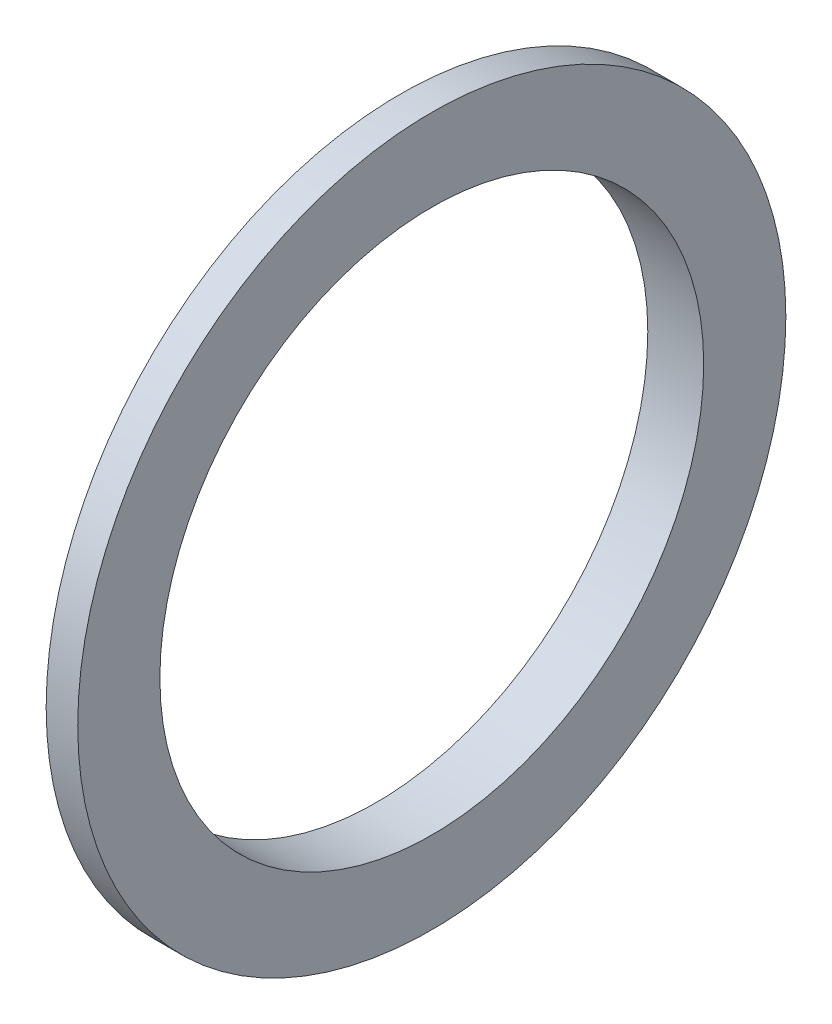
from build123d import *


with BuildPart() as part:
    # Sketch1 → Revolve1 (revolve)
    with BuildSketch(Plane.XY, mode=Mode.PRIVATE) as revolve1_sk:
        Polygon((-4.7625, 23.1648), (-2.689686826, 30.1625), (0, 30.1625), (0, 23.1648), align=None)
    revolve(revolve1_sk.sketch.rotate(Axis((0, 0, 0), (-1, 0, 0)), 90), axis=Axis((0, 0, 0), (-1, 0, 0)))


solid = part.part
